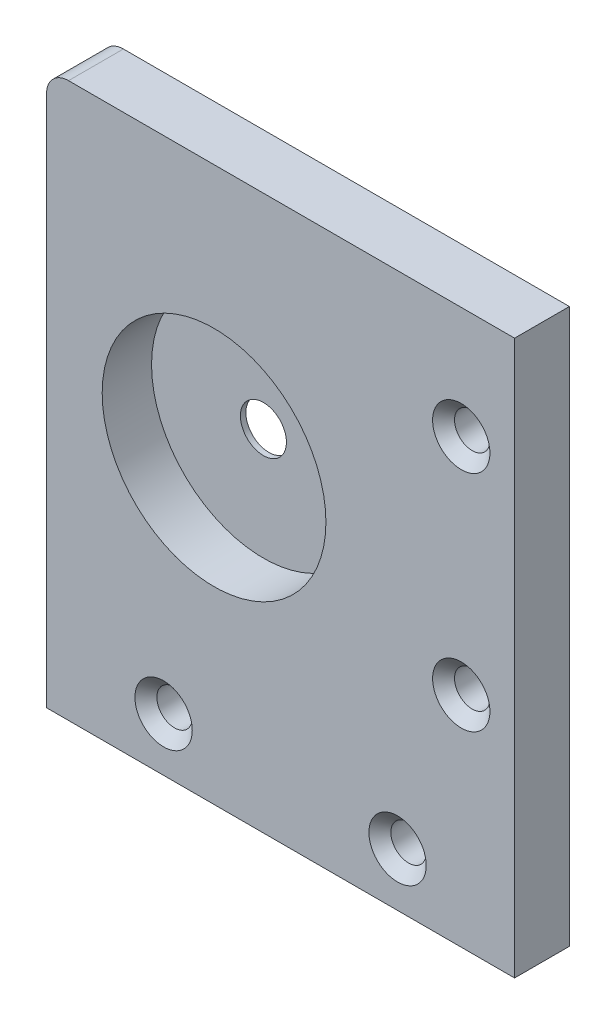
ISO-10303-21;
HEADER;
FILE_DESCRIPTION(('STEP AP214'),'2;1');
FILE_NAME('part.step','',(''),(''),'','','');
FILE_SCHEMA(('AUTOMOTIVE_DESIGN { 1 0 10303 214 1 1 1 1 }'));
ENDSEC;
DATA;
#1=APPLICATION_CONTEXT('core data for automotive mechanical design processes');
#2=APPLICATION_PROTOCOL_DEFINITION('international standard','automotive_design',2000,#1);
#3=PRODUCT_CONTEXT('',#1,'mechanical');
#4=PRODUCT('Part','Part','',(#3));
#5=PRODUCT_RELATED_PRODUCT_CATEGORY('part','',(#4));
#6=PRODUCT_DEFINITION_FORMATION('','',#4);
#7=PRODUCT_DEFINITION_CONTEXT('part definition',#1,'design');
#8=PRODUCT_DEFINITION('design','',#6,#7);
#9=PRODUCT_DEFINITION_SHAPE('','',#8);
#10=(LENGTH_UNIT() NAMED_UNIT(*) SI_UNIT(.MILLI.,.METRE.));
#11=(NAMED_UNIT(*) PLANE_ANGLE_UNIT() SI_UNIT($,.RADIAN.));
#12=(NAMED_UNIT(*) SI_UNIT($,.STERADIAN.) SOLID_ANGLE_UNIT());
#13=UNCERTAINTY_MEASURE_WITH_UNIT(LENGTH_MEASURE(1.E-05),#10,'distance_accuracy_value','');
#14=(GEOMETRIC_REPRESENTATION_CONTEXT(3) GLOBAL_UNCERTAINTY_ASSIGNED_CONTEXT((#13)) GLOBAL_UNIT_ASSIGNED_CONTEXT((#10,
#11,#12)) REPRESENTATION_CONTEXT('',''));
#15=CARTESIAN_POINT('',(0.,0.,0.));
#16=DIRECTION('',(0.,0.,1.));
#17=DIRECTION('',(1.,0.,0.));
#18=AXIS2_PLACEMENT_3D('',#15,#16,#17);
#19=CARTESIAN_POINT('',(-860.591749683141,583.545456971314,6.35));
#20=DIRECTION('',(0.,0.,-1.));
#21=DIRECTION('',(1.,0.,0.));
#22=AXIS2_PLACEMENT_3D('',#19,#20,#21);
#23=CYLINDRICAL_SURFACE('',#22,2.66700000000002);
#24=CARTESIAN_POINT('',(-860.591749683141,583.545456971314,0.));
#25=DIRECTION('',(0.,0.,-1.));
#26=DIRECTION('',(-1.,0.,0.));
#27=AXIS2_PLACEMENT_3D('',#24,#25,#26);
#28=CIRCLE('',#27,2.66700000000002);
#29=CARTESIAN_POINT('',(-863.258749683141,583.545456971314,0.));
#30=VERTEX_POINT('',#29);
#31=EDGE_CURVE('E192',#30,#30,#28,.T.);
#32=ORIENTED_EDGE('',*,*,#31,.T.);
#33=EDGE_LOOP('',(#32));
#34=FACE_BOUND('',#33,.T.);
#35=CARTESIAN_POINT('',(-860.591749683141,583.545456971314,0.635));
#36=DIRECTION('',(0.,0.,-1.));
#37=DIRECTION('',(-1.,0.,0.));
#38=AXIS2_PLACEMENT_3D('',#35,#36,#37);
#39=CIRCLE('',#38,2.66700000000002);
#40=CARTESIAN_POINT('',(-863.258749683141,583.545456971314,0.635));
#41=VERTEX_POINT('',#40);
#42=EDGE_CURVE('E185',#41,#41,#39,.T.);
#43=ORIENTED_EDGE('',*,*,#42,.F.);
#44=EDGE_LOOP('',(#43));
#45=FACE_BOUND('',#44,.T.);
#46=ADVANCED_FACE('F91',(#34,#45),#23,.F.);
#47=CARTESIAN_POINT('',(-879.982509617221,0.,6.35));
#48=DIRECTION('',(-1.,0.,0.));
#49=DIRECTION('',(0.,0.,-1.));
#50=AXIS2_PLACEMENT_3D('',#47,#48,#49);
#51=PLANE('',#50);
#52=DIRECTION('',(0.,-1.,0.));
#53=VECTOR('',#52,1.);
#54=CARTESIAN_POINT('',(-879.982509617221,0.,0.));
#55=LINE('',#54,#53);
#56=CARTESIAN_POINT('',(-879.982509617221,610.373454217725,0.));
#57=VERTEX_POINT('',#56);
#58=CARTESIAN_POINT('',(-879.982509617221,548.747456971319,0.));
#59=VERTEX_POINT('',#58);
#60=EDGE_CURVE('E154',#57,#59,#55,.T.);
#61=ORIENTED_EDGE('',*,*,#60,.T.);
#62=DIRECTION('',(0.,0.,1.));
#63=VECTOR('',#62,1.);
#64=CARTESIAN_POINT('',(-879.982509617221,548.747456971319,-83.9862899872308));
#65=LINE('',#64,#63);
#66=CARTESIAN_POINT('',(-879.982509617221,548.747456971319,6.35));
#67=VERTEX_POINT('',#66);
#68=EDGE_CURVE('E152',#59,#67,#65,.T.);
#69=ORIENTED_EDGE('',*,*,#68,.T.);
#70=DIRECTION('',(0.,-1.,0.));
#71=VECTOR('',#70,1.);
#72=CARTESIAN_POINT('',(-879.982509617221,0.,6.35));
#73=LINE('',#72,#71);
#74=CARTESIAN_POINT('',(-879.982509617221,610.373454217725,6.35));
#75=VERTEX_POINT('',#74);
#76=EDGE_CURVE('E139',#75,#67,#73,.T.);
#77=ORIENTED_EDGE('',*,*,#76,.F.);
#78=DIRECTION('',(0.,0.,-1.));
#79=VECTOR('',#78,1.);
#80=CARTESIAN_POINT('',(-879.982509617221,610.373454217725,6.35));
#81=LINE('',#80,#79);
#82=EDGE_CURVE('E191',#57,#75,#81,.F.);
#83=ORIENTED_EDGE('',*,*,#82,.F.);
#84=EDGE_LOOP('',(#61,#69,#77,#83));
#85=FACE_BOUND('',#84,.T.);
#86=ADVANCED_FACE('F153',(#85),#51,.T.);
#87=CARTESIAN_POINT('',(-1659.20749936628,612.913454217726,6.35));
#88=DIRECTION('',(0.,1.,0.));
#89=DIRECTION('',(0.,0.,1.));
#90=AXIS2_PLACEMENT_3D('',#87,#88,#89);
#91=PLANE('',#90);
#92=DIRECTION('',(-1.,0.,0.));
#93=VECTOR('',#92,1.);
#94=CARTESIAN_POINT('',(-1659.20749936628,612.913454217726,0.));
#95=LINE('',#94,#93);
#96=CARTESIAN_POINT('',(-825.793749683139,612.913454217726,0.));
#97=VERTEX_POINT('',#96);
#98=CARTESIAN_POINT('',(-877.442509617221,612.913454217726,0.));
#99=VERTEX_POINT('',#98);
#100=EDGE_CURVE('E149',#97,#99,#95,.T.);
#101=ORIENTED_EDGE('',*,*,#100,.T.);
#102=DIRECTION('',(0.,0.,-1.));
#103=VECTOR('',#102,1.);
#104=CARTESIAN_POINT('',(-877.442509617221,612.913454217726,6.35));
#105=LINE('',#104,#103);
#106=CARTESIAN_POINT('',(-877.442509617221,612.913454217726,6.35));
#107=VERTEX_POINT('',#106);
#108=EDGE_CURVE('E206',#107,#99,#105,.T.);
#109=ORIENTED_EDGE('',*,*,#108,.F.);
#110=DIRECTION('',(-1.,0.,0.));
#111=VECTOR('',#110,1.);
#112=CARTESIAN_POINT('',(-1659.20749936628,612.913454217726,6.35));
#113=LINE('',#112,#111);
#114=CARTESIAN_POINT('',(-825.793749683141,612.913454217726,6.35));
#115=VERTEX_POINT('',#114);
#116=EDGE_CURVE('E148',#115,#107,#113,.T.);
#117=ORIENTED_EDGE('',*,*,#116,.F.);
#118=DIRECTION('',(0.,0.,1.));
#119=VECTOR('',#118,1.);
#120=CARTESIAN_POINT('',(-825.793749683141,612.913454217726,-83.9862899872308));
#121=LINE('',#120,#119);
#122=EDGE_CURVE('E174',#97,#115,#121,.T.);
#123=ORIENTED_EDGE('',*,*,#122,.F.);
#124=EDGE_LOOP('',(#101,#109,#117,#123));
#125=FACE_BOUND('',#124,.T.);
#126=ADVANCED_FACE('F245',(#125),#91,.T.);
#127=CARTESIAN_POINT('',(-1659.20749936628,0.,6.35));
#128=DIRECTION('',(0.,0.,1.));
#129=DIRECTION('',(-1.,0.,0.));
#130=AXIS2_PLACEMENT_3D('',#127,#128,#129);
#131=PLANE('',#130);
#132=CARTESIAN_POINT('',(-866.435319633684,554.919656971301,6.35));
#133=DIRECTION('',(0.,0.,1.));
#134=DIRECTION('',(1.,0.,0.));
#135=AXIS2_PLACEMENT_3D('',#132,#133,#134);
#136=CIRCLE('',#135,3.31999999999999);
#137=CARTESIAN_POINT('',(-863.115319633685,554.919656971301,6.35));
#138=VERTEX_POINT('',#137);
#139=EDGE_CURVE('E222',#138,#138,#136,.F.);
#140=ORIENTED_EDGE('',*,*,#139,.T.);
#141=EDGE_LOOP('',(#140));
#142=FACE_BOUND('',#141,.T.);
#143=CARTESIAN_POINT('',(-839.340939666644,554.919656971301,6.35));
#144=DIRECTION('',(0.,0.,1.));
#145=DIRECTION('',(1.,0.,0.));
#146=AXIS2_PLACEMENT_3D('',#143,#144,#145);
#147=CIRCLE('',#146,3.31999999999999);
#148=CARTESIAN_POINT('',(-836.020939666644,554.919656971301,6.35));
#149=VERTEX_POINT('',#148);
#150=EDGE_CURVE('E219',#149,#149,#147,.F.);
#151=ORIENTED_EDGE('',*,*,#150,.T.);
#152=EDGE_LOOP('',(#151));
#153=FACE_BOUND('',#152,.T.);
#154=CARTESIAN_POINT('',(-831.965949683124,574.047256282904,6.35));
#155=DIRECTION('',(0.,0.,1.));
#156=DIRECTION('',(1.,0.,0.));
#157=AXIS2_PLACEMENT_3D('',#154,#155,#156);
#158=CIRCLE('',#157,3.31999999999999);
#159=CARTESIAN_POINT('',(-828.645949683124,574.047256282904,6.35));
#160=VERTEX_POINT('',#159);
#161=EDGE_CURVE('E216',#160,#160,#158,.F.);
#162=ORIENTED_EDGE('',*,*,#161,.T.);
#163=EDGE_LOOP('',(#162));
#164=FACE_BOUND('',#163,.T.);
#165=CARTESIAN_POINT('',(-831.965949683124,599.958054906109,6.35));
#166=DIRECTION('',(0.,0.,1.));
#167=DIRECTION('',(1.,0.,0.));
#168=AXIS2_PLACEMENT_3D('',#165,#166,#167);
#169=CIRCLE('',#168,3.31999999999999);
#170=CARTESIAN_POINT('',(-828.645949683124,599.958054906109,6.35));
#171=VERTEX_POINT('',#170);
#172=EDGE_CURVE('E213',#171,#171,#169,.F.);
#173=ORIENTED_EDGE('',*,*,#172,.T.);
#174=EDGE_LOOP('',(#173));
#175=FACE_BOUND('',#174,.T.);
#176=CARTESIAN_POINT('',(-860.591749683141,583.545456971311,6.35));
#177=DIRECTION('',(0.,0.,-1.));
#178=DIRECTION('',(-1.,0.,0.));
#179=AXIS2_PLACEMENT_3D('',#176,#177,#178);
#180=CIRCLE('',#179,12.954);
#181=CARTESIAN_POINT('',(-873.545749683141,583.545456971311,6.35));
#182=VERTEX_POINT('',#181);
#183=EDGE_CURVE('E180',#182,#182,#180,.T.);
#184=ORIENTED_EDGE('',*,*,#183,.T.);
#185=EDGE_LOOP('',(#184));
#186=FACE_BOUND('',#185,.T.);
#187=ORIENTED_EDGE('',*,*,#76,.T.);
#188=DIRECTION('',(1.,0.,0.));
#189=VECTOR('',#188,1.);
#190=CARTESIAN_POINT('',(0.,548.747456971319,6.35));
#191=LINE('',#190,#189);
#192=CARTESIAN_POINT('',(-825.793749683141,548.747456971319,6.35));
#193=VERTEX_POINT('',#192);
#194=EDGE_CURVE('E144',#67,#193,#191,.T.);
#195=ORIENTED_EDGE('',*,*,#194,.T.);
#196=DIRECTION('',(0.,1.,0.));
#197=VECTOR('',#196,1.);
#198=CARTESIAN_POINT('',(-825.79374968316,2.88760703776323E-11,6.35));
#199=LINE('',#198,#197);
#200=EDGE_CURVE('E159',#193,#115,#199,.T.);
#201=ORIENTED_EDGE('',*,*,#200,.T.);
#202=ORIENTED_EDGE('',*,*,#116,.T.);
#203=CARTESIAN_POINT('',(-877.442509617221,610.373454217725,6.35));
#204=DIRECTION('',(0.,0.,-1.));
#205=DIRECTION('',(-1.,0.,0.));
#206=AXIS2_PLACEMENT_3D('',#203,#204,#205);
#207=CIRCLE('',#206,2.54);
#208=EDGE_CURVE('E107',#75,#107,#207,.T.);
#209=ORIENTED_EDGE('',*,*,#208,.F.);
#210=EDGE_LOOP('',(#187,#195,#201,#202,#209));
#211=FACE_BOUND('',#210,.T.);
#212=ADVANCED_FACE('F141',(#142,#153,#164,#175,#186,#211),#131,.T.);
#213=CARTESIAN_POINT('',(-1659.20749936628,0.,0.));
#214=DIRECTION('',(0.,0.,1.));
#215=DIRECTION('',(-1.,0.,0.));
#216=AXIS2_PLACEMENT_3D('',#213,#214,#215);
#217=PLANE('',#216);
#218=CARTESIAN_POINT('',(-831.965949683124,599.958054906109,0.));
#219=DIRECTION('',(0.,0.,1.));
#220=DIRECTION('',(1.,0.,0.));
#221=AXIS2_PLACEMENT_3D('',#218,#219,#220);
#222=CIRCLE('',#221,2.05000000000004);
#223=CARTESIAN_POINT('',(-829.915949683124,599.958054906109,0.));
#224=VERTEX_POINT('',#223);
#225=EDGE_CURVE('E164',#224,#224,#222,.F.);
#226=ORIENTED_EDGE('',*,*,#225,.F.);
#227=EDGE_LOOP('',(#226));
#228=FACE_BOUND('',#227,.T.);
#229=CARTESIAN_POINT('',(-839.340939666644,554.919656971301,0.));
#230=DIRECTION('',(0.,0.,1.));
#231=DIRECTION('',(1.,0.,0.));
#232=AXIS2_PLACEMENT_3D('',#229,#230,#231);
#233=CIRCLE('',#232,2.05000000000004);
#234=CARTESIAN_POINT('',(-837.290939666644,554.919656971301,0.));
#235=VERTEX_POINT('',#234);
#236=EDGE_CURVE('E168',#235,#235,#233,.F.);
#237=ORIENTED_EDGE('',*,*,#236,.F.);
#238=EDGE_LOOP('',(#237));
#239=FACE_BOUND('',#238,.T.);
#240=CARTESIAN_POINT('',(-866.435319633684,554.919656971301,0.));
#241=DIRECTION('',(0.,0.,1.));
#242=DIRECTION('',(1.,0.,0.));
#243=AXIS2_PLACEMENT_3D('',#240,#241,#242);
#244=CIRCLE('',#243,2.05000000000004);
#245=CARTESIAN_POINT('',(-864.385319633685,554.919656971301,0.));
#246=VERTEX_POINT('',#245);
#247=EDGE_CURVE('E312',#246,#246,#244,.F.);
#248=ORIENTED_EDGE('',*,*,#247,.F.);
#249=EDGE_LOOP('',(#248));
#250=FACE_BOUND('',#249,.T.);
#251=CARTESIAN_POINT('',(-831.965949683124,574.047256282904,0.));
#252=DIRECTION('',(0.,0.,-1.));
#253=DIRECTION('',(-1.,0.,0.));
#254=AXIS2_PLACEMENT_3D('',#251,#252,#253);
#255=CIRCLE('',#254,2.05000000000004);
#256=CARTESIAN_POINT('',(-834.015949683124,574.047256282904,0.));
#257=VERTEX_POINT('',#256);
#258=EDGE_CURVE('E315',#257,#257,#255,.T.);
#259=ORIENTED_EDGE('',*,*,#258,.F.);
#260=EDGE_LOOP('',(#259));
#261=FACE_BOUND('',#260,.T.);
#262=ORIENTED_EDGE('',*,*,#100,.F.);
#263=DIRECTION('',(0.,-1.,0.));
#264=VECTOR('',#263,1.);
#265=CARTESIAN_POINT('',(-825.79374968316,2.88760703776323E-11,0.));
#266=LINE('',#265,#264);
#267=CARTESIAN_POINT('',(-825.793749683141,548.747456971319,0.));
#268=VERTEX_POINT('',#267);
#269=EDGE_CURVE('E171',#97,#268,#266,.T.);
#270=ORIENTED_EDGE('',*,*,#269,.T.);
#271=DIRECTION('',(-1.,0.,0.));
#272=VECTOR('',#271,1.);
#273=CARTESIAN_POINT('',(0.,548.747456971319,0.));
#274=LINE('',#273,#272);
#275=EDGE_CURVE('E178',#268,#59,#274,.T.);
#276=ORIENTED_EDGE('',*,*,#275,.T.);
#277=ORIENTED_EDGE('',*,*,#60,.F.);
#278=CARTESIAN_POINT('',(-877.442509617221,610.373454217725,0.));
#279=DIRECTION('',(0.,0.,-1.));
#280=DIRECTION('',(-1.,0.,0.));
#281=AXIS2_PLACEMENT_3D('',#278,#279,#280);
#282=CIRCLE('',#281,2.54);
#283=EDGE_CURVE('E115',#99,#57,#282,.F.);
#284=ORIENTED_EDGE('',*,*,#283,.F.);
#285=EDGE_LOOP('',(#262,#270,#276,#277,#284));
#286=FACE_BOUND('',#285,.T.);
#287=ORIENTED_EDGE('',*,*,#31,.F.);
#288=EDGE_LOOP('',(#287));
#289=FACE_BOUND('',#288,.T.);
#290=ADVANCED_FACE('F244',(#228,#239,#250,#261,#286,#289),#217,.F.);
#291=CARTESIAN_POINT('',(-860.591749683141,583.545456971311,0.635));
#292=DIRECTION('',(0.,0.,1.));
#293=DIRECTION('',(-1.,0.,0.));
#294=AXIS2_PLACEMENT_3D('',#291,#292,#293);
#295=CYLINDRICAL_SURFACE('',#294,12.954);
#296=CARTESIAN_POINT('',(-860.591749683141,583.545456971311,0.635));
#297=DIRECTION('',(0.,0.,-1.));
#298=DIRECTION('',(-1.,0.,0.));
#299=AXIS2_PLACEMENT_3D('',#296,#297,#298);
#300=CIRCLE('',#299,12.954);
#301=CARTESIAN_POINT('',(-873.545749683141,583.545456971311,0.635));
#302=VERTEX_POINT('',#301);
#303=EDGE_CURVE('E181',#302,#302,#300,.T.);
#304=ORIENTED_EDGE('',*,*,#303,.T.);
#305=EDGE_LOOP('',(#304));
#306=FACE_BOUND('',#305,.T.);
#307=ORIENTED_EDGE('',*,*,#183,.F.);
#308=EDGE_LOOP('',(#307));
#309=FACE_BOUND('',#308,.T.);
#310=ADVANCED_FACE('F252',(#306,#309),#295,.F.);
#311=CARTESIAN_POINT('',(-1659.20749936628,0.,0.635));
#312=DIRECTION('',(0.,0.,1.));
#313=DIRECTION('',(-1.,0.,0.));
#314=AXIS2_PLACEMENT_3D('',#311,#312,#313);
#315=PLANE('',#314);
#316=ORIENTED_EDGE('',*,*,#42,.T.);
#317=EDGE_LOOP('',(#316));
#318=FACE_BOUND('',#317,.T.);
#319=ORIENTED_EDGE('',*,*,#303,.F.);
#320=EDGE_LOOP('',(#319));
#321=FACE_BOUND('',#320,.T.);
#322=ADVANCED_FACE('F254',(#318,#321),#315,.T.);
#323=CARTESIAN_POINT('',(-877.442509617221,610.373454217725,6.35));
#324=DIRECTION('',(0.,0.,-1.));
#325=DIRECTION('',(1.,0.,0.));
#326=AXIS2_PLACEMENT_3D('',#323,#324,#325);
#327=CYLINDRICAL_SURFACE('',#326,2.54);
#328=ORIENTED_EDGE('',*,*,#208,.T.);
#329=ORIENTED_EDGE('',*,*,#108,.T.);
#330=ORIENTED_EDGE('',*,*,#283,.T.);
#331=ORIENTED_EDGE('',*,*,#82,.T.);
#332=EDGE_LOOP('',(#328,#329,#330,#331));
#333=FACE_BOUND('',#332,.T.);
#334=ADVANCED_FACE('F261',(#333),#327,.T.);
#335=CARTESIAN_POINT('',(-825.79374968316,2.88760703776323E-11,-83.9862899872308));
#336=DIRECTION('',(1.,0.,0.));
#337=DIRECTION('',(0.,1.,0.));
#338=AXIS2_PLACEMENT_3D('',#335,#336,#337);
#339=PLANE('',#338);
#340=ORIENTED_EDGE('',*,*,#269,.F.);
#341=ORIENTED_EDGE('',*,*,#122,.T.);
#342=ORIENTED_EDGE('',*,*,#200,.F.);
#343=DIRECTION('',(0.,0.,1.));
#344=VECTOR('',#343,1.);
#345=CARTESIAN_POINT('',(-825.793749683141,548.747456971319,-83.9862899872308));
#346=LINE('',#345,#344);
#347=EDGE_CURVE('E158',#268,#193,#346,.T.);
#348=ORIENTED_EDGE('',*,*,#347,.F.);
#349=EDGE_LOOP('',(#340,#341,#342,#348));
#350=FACE_BOUND('',#349,.T.);
#351=ADVANCED_FACE('F278',(#350),#339,.T.);
#352=CARTESIAN_POINT('',(0.,548.747456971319,-83.9862899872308));
#353=DIRECTION('',(0.,-1.,0.));
#354=DIRECTION('',(0.,0.,-1.));
#355=AXIS2_PLACEMENT_3D('',#352,#353,#354);
#356=PLANE('',#355);
#357=ORIENTED_EDGE('',*,*,#275,.F.);
#358=ORIENTED_EDGE('',*,*,#347,.T.);
#359=ORIENTED_EDGE('',*,*,#194,.F.);
#360=ORIENTED_EDGE('',*,*,#68,.F.);
#361=EDGE_LOOP('',(#357,#358,#359,#360));
#362=FACE_BOUND('',#361,.T.);
#363=ADVANCED_FACE('F161',(#362),#356,.T.);
#364=CARTESIAN_POINT('',(-831.965949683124,574.047256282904,0.));
#365=DIRECTION('',(0.,0.,1.));
#366=DIRECTION('',(1.,0.,0.));
#367=AXIS2_PLACEMENT_3D('',#364,#365,#366);
#368=CYLINDRICAL_SURFACE('',#367,2.05000000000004);
#369=CARTESIAN_POINT('',(-831.965949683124,574.047256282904,5.08000000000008));
#370=DIRECTION('',(0.,0.,1.));
#371=DIRECTION('',(1.,0.,0.));
#372=AXIS2_PLACEMENT_3D('',#369,#370,#371);
#373=CIRCLE('',#372,2.05000000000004);
#374=CARTESIAN_POINT('',(-829.915949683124,574.047256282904,5.08000000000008));
#375=VERTEX_POINT('',#374);
#376=EDGE_CURVE('E100',#375,#375,#373,.T.);
#377=ORIENTED_EDGE('',*,*,#376,.T.);
#378=EDGE_LOOP('',(#377));
#379=FACE_BOUND('',#378,.T.);
#380=ORIENTED_EDGE('',*,*,#258,.T.);
#381=EDGE_LOOP('',(#380));
#382=FACE_BOUND('',#381,.T.);
#383=ADVANCED_FACE('F233',(#379,#382),#368,.F.);
#384=CARTESIAN_POINT('',(-866.435319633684,554.919656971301,0.));
#385=DIRECTION('',(0.,0.,1.));
#386=DIRECTION('',(1.,0.,0.));
#387=AXIS2_PLACEMENT_3D('',#384,#385,#386);
#388=CYLINDRICAL_SURFACE('',#387,2.05000000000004);
#389=CARTESIAN_POINT('',(-866.435319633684,554.919656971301,5.08000000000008));
#390=DIRECTION('',(0.,0.,1.));
#391=DIRECTION('',(1.,0.,0.));
#392=AXIS2_PLACEMENT_3D('',#389,#390,#391);
#393=CIRCLE('',#392,2.05000000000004);
#394=CARTESIAN_POINT('',(-864.385319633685,554.919656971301,5.08000000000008));
#395=VERTEX_POINT('',#394);
#396=EDGE_CURVE('E225',#395,#395,#393,.T.);
#397=ORIENTED_EDGE('',*,*,#396,.T.);
#398=EDGE_LOOP('',(#397));
#399=FACE_BOUND('',#398,.T.);
#400=ORIENTED_EDGE('',*,*,#247,.T.);
#401=EDGE_LOOP('',(#400));
#402=FACE_BOUND('',#401,.T.);
#403=ADVANCED_FACE('F307',(#399,#402),#388,.F.);
#404=CARTESIAN_POINT('',(-839.340939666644,554.919656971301,0.));
#405=DIRECTION('',(0.,0.,1.));
#406=DIRECTION('',(1.,0.,0.));
#407=AXIS2_PLACEMENT_3D('',#404,#405,#406);
#408=CYLINDRICAL_SURFACE('',#407,2.05000000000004);
#409=CARTESIAN_POINT('',(-839.340939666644,554.919656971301,5.08000000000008));
#410=DIRECTION('',(0.,0.,1.));
#411=DIRECTION('',(1.,0.,0.));
#412=AXIS2_PLACEMENT_3D('',#409,#410,#411);
#413=CIRCLE('',#412,2.05000000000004);
#414=CARTESIAN_POINT('',(-837.290939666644,554.919656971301,5.08000000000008));
#415=VERTEX_POINT('',#414);
#416=EDGE_CURVE('E228',#415,#415,#413,.T.);
#417=ORIENTED_EDGE('',*,*,#416,.T.);
#418=EDGE_LOOP('',(#417));
#419=FACE_BOUND('',#418,.T.);
#420=ORIENTED_EDGE('',*,*,#236,.T.);
#421=EDGE_LOOP('',(#420));
#422=FACE_BOUND('',#421,.T.);
#423=ADVANCED_FACE('F304',(#419,#422),#408,.F.);
#424=CARTESIAN_POINT('',(-831.965949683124,599.958054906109,0.));
#425=DIRECTION('',(0.,0.,1.));
#426=DIRECTION('',(1.,0.,0.));
#427=AXIS2_PLACEMENT_3D('',#424,#425,#426);
#428=CYLINDRICAL_SURFACE('',#427,2.05000000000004);
#429=CARTESIAN_POINT('',(-831.965949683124,599.958054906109,5.08000000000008));
#430=DIRECTION('',(0.,0.,1.));
#431=DIRECTION('',(1.,0.,0.));
#432=AXIS2_PLACEMENT_3D('',#429,#430,#431);
#433=CIRCLE('',#432,2.05000000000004);
#434=CARTESIAN_POINT('',(-829.915949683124,599.958054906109,5.08000000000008));
#435=VERTEX_POINT('',#434);
#436=EDGE_CURVE('E12',#435,#435,#433,.T.);
#437=ORIENTED_EDGE('',*,*,#436,.T.);
#438=EDGE_LOOP('',(#437));
#439=FACE_BOUND('',#438,.T.);
#440=ORIENTED_EDGE('',*,*,#225,.T.);
#441=EDGE_LOOP('',(#440));
#442=FACE_BOUND('',#441,.T.);
#443=ADVANCED_FACE('F286',(#439,#442),#428,.F.);
#444=CARTESIAN_POINT('',(-866.435319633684,554.919656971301,6.35));
#445=DIRECTION('',(0.,0.,1.));
#446=DIRECTION('',(1.,0.,0.));
#447=AXIS2_PLACEMENT_3D('',#444,#445,#446);
#448=CONICAL_SURFACE('',#447,3.31999999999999,0.785398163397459);
#449=ORIENTED_EDGE('',*,*,#396,.F.);
#450=EDGE_LOOP('',(#449));
#451=FACE_BOUND('',#450,.T.);
#452=ORIENTED_EDGE('',*,*,#139,.F.);
#453=EDGE_LOOP('',(#452));
#454=FACE_BOUND('',#453,.T.);
#455=ADVANCED_FACE('F280',(#451,#454),#448,.F.);
#456=CARTESIAN_POINT('',(-839.340939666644,554.919656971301,6.35));
#457=DIRECTION('',(0.,0.,1.));
#458=DIRECTION('',(1.,0.,0.));
#459=AXIS2_PLACEMENT_3D('',#456,#457,#458);
#460=CONICAL_SURFACE('',#459,3.31999999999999,0.785398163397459);
#461=ORIENTED_EDGE('',*,*,#416,.F.);
#462=EDGE_LOOP('',(#461));
#463=FACE_BOUND('',#462,.T.);
#464=ORIENTED_EDGE('',*,*,#150,.F.);
#465=EDGE_LOOP('',(#464));
#466=FACE_BOUND('',#465,.T.);
#467=ADVANCED_FACE('F239',(#463,#466),#460,.F.);
#468=CARTESIAN_POINT('',(-831.965949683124,574.047256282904,6.35));
#469=DIRECTION('',(0.,0.,1.));
#470=DIRECTION('',(1.,0.,0.));
#471=AXIS2_PLACEMENT_3D('',#468,#469,#470);
#472=CONICAL_SURFACE('',#471,3.31999999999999,0.785398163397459);
#473=ORIENTED_EDGE('',*,*,#376,.F.);
#474=EDGE_LOOP('',(#473));
#475=FACE_BOUND('',#474,.T.);
#476=ORIENTED_EDGE('',*,*,#161,.F.);
#477=EDGE_LOOP('',(#476));
#478=FACE_BOUND('',#477,.T.);
#479=ADVANCED_FACE('F236',(#475,#478),#472,.F.);
#480=CARTESIAN_POINT('',(-831.965949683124,599.958054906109,6.35));
#481=DIRECTION('',(0.,0.,1.));
#482=DIRECTION('',(1.,0.,0.));
#483=AXIS2_PLACEMENT_3D('',#480,#481,#482);
#484=CONICAL_SURFACE('',#483,3.31999999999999,0.785398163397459);
#485=ORIENTED_EDGE('',*,*,#436,.F.);
#486=EDGE_LOOP('',(#485));
#487=FACE_BOUND('',#486,.T.);
#488=ORIENTED_EDGE('',*,*,#172,.F.);
#489=EDGE_LOOP('',(#488));
#490=FACE_BOUND('',#489,.T.);
#491=ADVANCED_FACE('F94',(#487,#490),#484,.F.);
#492=CLOSED_SHELL('',(#46,#86,#126,#212,#290,#310,#322,#334,#351,#363,#383,#403,#423,#443,#455,
#467,#479,#491));
#493=MANIFOLD_SOLID_BREP('B2',#492);
#494=ADVANCED_BREP_SHAPE_REPRESENTATION('',(#18,#493),#14);
#495=SHAPE_DEFINITION_REPRESENTATION(#9,#494);
ENDSEC;
END-ISO-10303-21;
